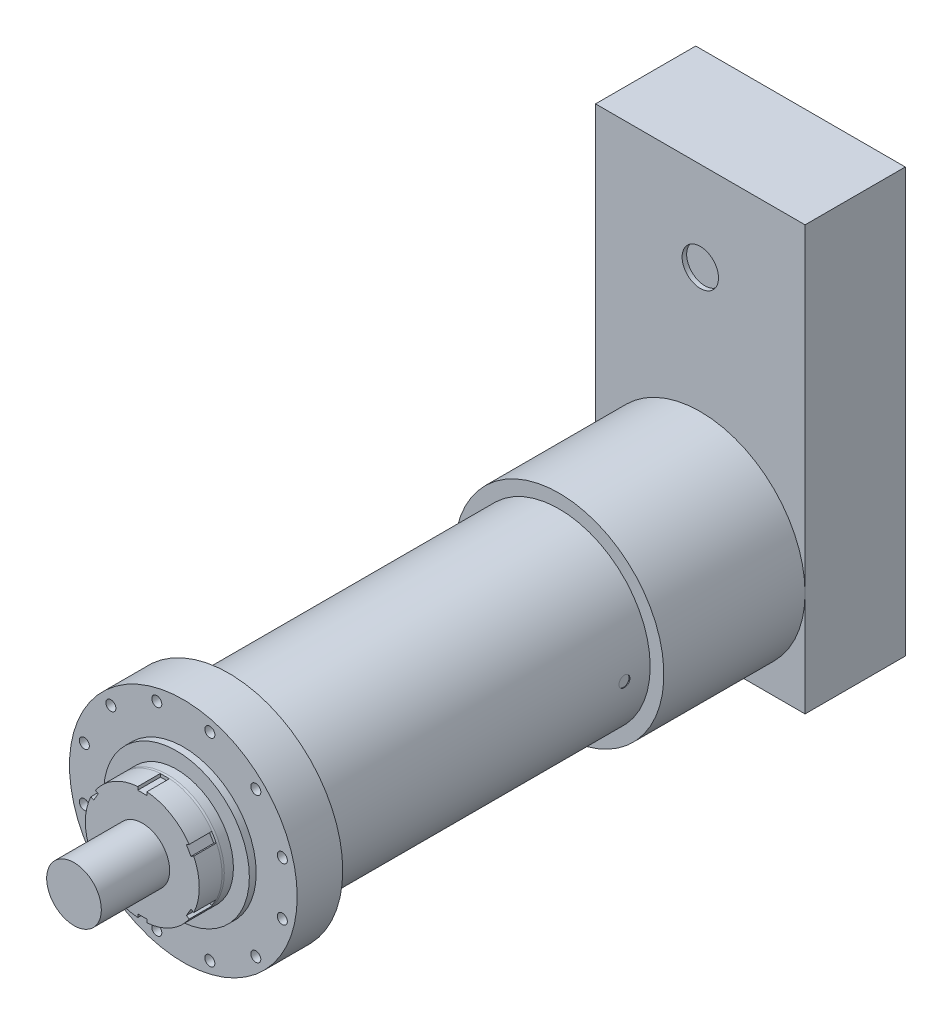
from build123d import *

# Parameters (mm, degrees)
SKETCH_1_R          = 200
EXTRUDE_1_DEPTH     = 725
SKETCH_2_R          = 250
SKETCH_2_R_2        = 11
EXTRUDE_2_DEPTH     = 100
SKETCH_3_R          = 160
EXTRUDE_3_DEPTH     = 15
SKETCH_4_R          = 125
EXTRUDE_4_DEPTH     = 25
CHAMFER_1_SIZE      = 5
CHAMFER_1_SIZE2     = 0.881634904
SKETCH_6_R          = 230
EXTRUDE_6_DEPTH     = 310
SKETCH_9_R          = 12
CUT_EXTRUDE_2_DEPTH = 2
SKETCH_10_R         = 12
CUT_EXTRUDE_3_DEPTH = 2
EXTRUDE_7_DEPTH     = 50
SKETCH_11_R         = 60
EXTRUDE_8_DEPTH     = 150
SKETCH_12_W         = 460
SKETCH_12_H         = 930
EXTRUDE_9_DEPTH     = 220
SKETCH_13_R         = 40
CUT_EXTRUDE_4_DEPTH = 10


with BuildPart() as part:
    # Sketch 1 → Extrude 1 (new body)
    with BuildSketch(Plane.XY):
        Circle(SKETCH_1_R)
    extrude(amount=EXTRUDE_1_DEPTH)

    # Sketch 2 → Extrude 2 (add)
    with BuildSketch(Plane.XY.offset(725)):
        Circle(SKETCH_2_R)
        with Locations((217.333310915, 58.234285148)):
            Circle(SKETCH_2_R_2, mode=Mode.SUBTRACT)
        with Locations((217.333310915, -58.234285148)):
            Circle(SKETCH_2_R_2, mode=Mode.SUBTRACT)
        with Locations((159.099025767, -159.099025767)):
            Circle(SKETCH_2_R_2, mode=Mode.SUBTRACT)
        with Locations((58.234285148, -217.333310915)):
            Circle(SKETCH_2_R_2, mode=Mode.SUBTRACT)
        with Locations((-58.234285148, -217.333310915)):
            Circle(SKETCH_2_R_2, mode=Mode.SUBTRACT)
        with Locations((-159.099025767, -159.099025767)):
            Circle(SKETCH_2_R_2, mode=Mode.SUBTRACT)
        with Locations((-217.333310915, -58.234285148)):
            Circle(SKETCH_2_R_2, mode=Mode.SUBTRACT)
        with Locations((-217.333310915, 58.234285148)):
            Circle(SKETCH_2_R_2, mode=Mode.SUBTRACT)
        with Locations((-159.099025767, 159.099025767)):
            Circle(SKETCH_2_R_2, mode=Mode.SUBTRACT)
        with Locations((-58.234285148, 217.333310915)):
            Circle(SKETCH_2_R_2, mode=Mode.SUBTRACT)
        with Locations((58.234285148, 217.333310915)):
            Circle(SKETCH_2_R_2, mode=Mode.SUBTRACT)
        with Locations((159.099025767, 159.099025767)):
            Circle(SKETCH_2_R_2, mode=Mode.SUBTRACT)
    extrude(amount=EXTRUDE_2_DEPTH)

    # Sketch 3 → Extrude 3 (add)
    with BuildSketch(Plane.XY.offset(825)):
        Circle(SKETCH_3_R)
    extrude(amount=EXTRUDE_3_DEPTH)

    # Sketch 4 → Extrude 4 (add)
    with BuildSketch(Plane.XY.offset(840)):
        Circle(SKETCH_4_R)
    extrude(amount=EXTRUDE_4_DEPTH)

    # Chamfer 1
    chamfer_1_edges = [part.edges().sort_by_distance(p)[0] for p in [
        (-125, 0, 865),
    ]]
    chamfer_1_side = [part.faces().sort_by_distance(p)[0] for p in [
        (-125, 0, 852.5),
    ]]
    chamfer(chamfer_1_edges, length=CHAMFER_1_SIZE, length2=CHAMFER_1_SIZE2, reference=chamfer_1_side[0])

    # Sketch 6 → Extrude 6 (add)
    with BuildSketch(Plane(origin=(0, 0, 0), x_dir=(-1, 0, 0), z_dir=(0, 0, -1))):
        Circle(SKETCH_6_R)
    extrude(amount=EXTRUDE_6_DEPTH)

    # Sketch 9 → Cut-Extrude 2 (cut)
    with BuildSketch(Plane(origin=(-200, 0, 0), x_dir=(0, 0, -1), z_dir=(1, 0, 0))):
        with Locations(Location((-36.5, 0, 0), (0, 0, 180))):
            Circle(SKETCH_9_R)
        with Locations(Location((-670.5, 0, 0), (0, 0, 180))):
            Circle(SKETCH_9_R)
    extrude(amount=CUT_EXTRUDE_2_DEPTH, mode=Mode.SUBTRACT)

    # Sketch 10 → Cut-Extrude 3 (cut)
    with BuildSketch(Plane(origin=(200, 0, 0), x_dir=(0, 0, -1), z_dir=(1, 0, 0))):
        with Locations((-56.5, 0)):
            Circle(SKETCH_10_R)
    extrude(amount=-CUT_EXTRUDE_3_DEPTH, mode=Mode.SUBTRACT)

    # Sketch 5 → Extrude 7 (add)
    with BuildSketch(Plane.XY.offset(865)):
        with BuildLine():
            Line((-10, 124.599357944), (-10, 117.5))
            Line((-10, 117.5), (10, 117.5))
            Line((10, 117.5), (10, 124.599357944))
            ThreePointArc((10, 124.599357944), (62.5, 108.253175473), (102.906209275, 70.95993301))
            Line((102.906209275, 70.95993301), (96.757984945, 67.410254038))
            Line((96.757984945, 67.410254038), (106.757984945, 50.089745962))
            Line((106.757984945, 50.089745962), (112.906209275, 53.639424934))
            ThreePointArc((112.906209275, 53.639424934), (125, 0), (112.906209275, -53.639424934))
            Line((112.906209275, -53.639424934), (106.757984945, -50.089745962))
            Line((106.757984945, -50.089745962), (96.757984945, -67.410254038))
            Line((96.757984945, -67.410254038), (102.906209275, -70.95993301))
            ThreePointArc((102.906209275, -70.95993301), (62.5, -108.253175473), (10, -124.599357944))
            Line((10, -124.599357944), (10, -117.5))
            Line((10, -117.5), (-10, -117.5))
            Line((-10, -117.5), (-10, -124.599357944))
            ThreePointArc((-10, -124.599357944), (-62.5, -108.253175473), (-102.906209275, -70.95993301))
            Line((-102.906209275, -70.95993301), (-96.757984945, -67.410254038))
            Line((-96.757984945, -67.410254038), (-106.757984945, -50.089745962))
            Line((-106.757984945, -50.089745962), (-112.906209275, -53.639424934))
            ThreePointArc((-112.906209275, -53.639424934), (-125, 0), (-112.906209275, 53.639424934))
            Line((-112.906209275, 53.639424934), (-106.757984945, 50.089745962))
            Line((-106.757984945, 50.089745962), (-96.757984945, 67.410254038))
            Line((-96.757984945, 67.410254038), (-102.906209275, 70.95993301))
            ThreePointArc((-102.906209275, 70.95993301), (-62.5, 108.253175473), (-10, 124.599357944))
        make_face()
    extrude(amount=EXTRUDE_7_DEPTH)

    # Sketch 11 → Extrude 8 (add)
    with BuildSketch(Plane.XY.offset(915)):
        Circle(SKETCH_11_R)
    extrude(amount=EXTRUDE_8_DEPTH)

    # Sketch 12 → Extrude 9 (add)
    with BuildSketch(Plane(origin=(0, 0, -310), x_dir=(-1, 0, 0), z_dir=(0, 0, -1))):
        with Locations((0, 235)):
            Rectangle(SKETCH_12_W, SKETCH_12_H)
    extrude(amount=EXTRUDE_9_DEPTH)

    # Sketch 13 → Cut-Extrude 4 (cut)
    with BuildSketch(Plane.XY.offset(-310)):
        with Locations((0, 504)):
            Circle(SKETCH_13_R)
    extrude(amount=-CUT_EXTRUDE_4_DEPTH, mode=Mode.SUBTRACT)


solid = part.part
